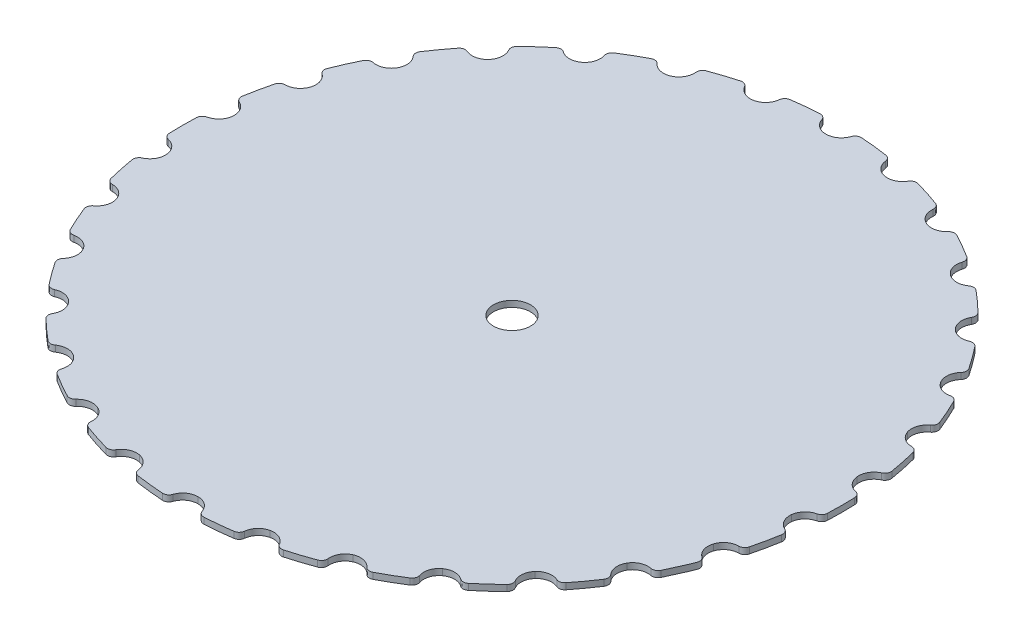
from build123d import *

# Parameters (mm, degrees)
SKETCH1_R           = 3
BOSS_EXTRUDE1_DEPTH = 1


with BuildPart() as part:
    # Sketch1 → Boss-Extrude1 (new body)
    with BuildSketch(Plane(origin=(0, 0, 0), x_dir=(1, 0, 0), z_dir=(0, 1, 0))):
        with BuildLine():
            add(Edge.make_bspline(
                [(-30.729, 38.4268), (-29.6819, 39.4503), (-28.5937, 40.4313), (-27.4664, 41.3656), (-27.1101, 41.6609), (-26.6154, 41.6768), (-26.2409, 41.405)],
                knots=[0.986666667, 0.986666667, 0.986666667, 0.986666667, 0.993333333, 0.993333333, 0.993333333, 1, 1, 1, 1], degree=3))
            add(Edge.make_bspline(
                [(-26.2409, 41.405), (-25.3885, 40.7865), (-24.2014, 40.754), (-23.3032, 41.4066)],
                knots=[0, 0, 0, 0, 0.006666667, 0.006666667, 0.006666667, 0.006666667], degree=3))
            add(Edge.make_bspline(
                [(-23.3032, 41.4066), (-22.4043, 42.0597), (-22.0687, 43.2), (-22.3949, 44.2023)],
                knots=[0.006666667, 0.006666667, 0.006666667, 0.006666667, 0.013333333, 0.013333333, 0.013333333, 0.013333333], degree=3))
            add(Edge.make_bspline(
                [(-22.3949, 44.2023), (-22.5381, 44.6424), (-22.3705, 45.1081), (-21.9797, 45.3562)],
                knots=[0.013333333, 0.013333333, 0.013333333, 0.013333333, 0.02, 0.02, 0.02, 0.02], degree=3))
            add(Edge.make_bspline(
                [(-21.9797, 45.3562), (-20.7353, 46.1457), (-19.4671, 46.878), (-18.1791, 47.5531)],
                knots=[0.02, 0.02, 0.02, 0.02, 0.026666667, 0.026666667, 0.026666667, 0.026666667], degree=3))
            add(Edge.make_bspline(
                [(-18.1791, 47.5531), (-17.7687, 47.7682), (-17.2808, 47.6804), (-16.9711, 47.3357)],
                knots=[0.026666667, 0.026666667, 0.026666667, 0.026666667, 0.033333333, 0.033333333, 0.033333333, 0.033333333], degree=3))
            add(Edge.make_bspline(
                [(-16.9711, 47.3357), (-16.2662, 46.5511), (-15.1102, 46.2714), (-14.0947, 46.7236)],
                knots=[0.033333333, 0.033333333, 0.033333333, 0.033333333, 0.04, 0.04, 0.04, 0.04], degree=3))
            add(Edge.make_bspline(
                [(-14.0947, 46.7236), (-13.0798, 47.1755), (-12.5144, 48.2207), (-12.6248, 49.269)],
                knots=[0.04, 0.04, 0.04, 0.04, 0.046666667, 0.046666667, 0.046666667, 0.046666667], degree=3))
            add(Edge.make_bspline(
                [(-12.6248, 49.269), (-12.6734, 49.7298), (-12.4119, 50.1508), (-11.9774, 50.3116)],
                knots=[0.046666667, 0.046666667, 0.046666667, 0.046666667, 0.053333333, 0.053333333, 0.053333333, 0.053333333], degree=3))
            add(Edge.make_bspline(
                [(-11.9774, 50.3116), (-10.5987, 50.8219), (-9.2044, 51.2724), (-7.7986, 51.6636)],
                knots=[0.053333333, 0.053333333, 0.053333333, 0.053333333, 0.06, 0.06, 0.06, 0.06], degree=3))
            add(Edge.make_bspline(
                [(-7.7986, 51.6636), (-7.3536, 51.7874), (-6.8967, 51.6012), (-6.6652, 51.2015)],
                knots=[0.06, 0.06, 0.06, 0.06, 0.066666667, 0.066666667, 0.066666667, 0.066666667], degree=3))
            add(Edge.make_bspline(
                [(-6.6652, 51.2015), (-6.1378, 50.2906), (-5.0672, 49.779), (-3.9819, 50.0097)],
                knots=[0.066666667, 0.066666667, 0.066666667, 0.066666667, 0.073333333, 0.073333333, 0.073333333, 0.073333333], degree=3))
            add(Edge.make_bspline(
                [(-3.9819, 50.0097), (-2.8995, 50.2399), (-2.1307, 51.1386), (-2.0162, 52.1817)],
                knots=[0.073333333, 0.073333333, 0.073333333, 0.073333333, 0.08, 0.08, 0.08, 0.08], degree=3))
            add(Edge.make_bspline(
                [(-2.0162, 52.1817), (-1.9658, 52.6408), (-1.6229, 52.9958), (-1.1658, 53.0621)],
                knots=[0.08, 0.08, 0.08, 0.08, 0.086666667, 0.086666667, 0.086666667, 0.086666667], degree=3))
            add(Edge.make_bspline(
                [(-1.1658, 53.0621), (0.288, 53.2731), (1.7478, 53.4241), (3.2093, 53.5148)],
                knots=[0.086666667, 0.086666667, 0.086666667, 0.086666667, 0.093333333, 0.093333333, 0.093333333, 0.093333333], degree=3))
            add(Edge.make_bspline(
                [(3.2093, 53.5148), (3.6684, 53.5433), (4.0752, 53.2686), (4.2203, 52.8321)],
                knots=[0.093333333, 0.093333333, 0.093333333, 0.093333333, 0.1, 0.1, 0.1, 0.1], degree=3))
            add(Edge.make_bspline(
                [(4.2203, 52.8321), (4.5506, 51.8383), (5.4883, 51.1215), (6.5932, 51.1215), (7.6964, 51.1215), (8.6327, 51.8363), (8.9645, 52.8278)],
                knots=[0.1, 0.1, 0.1, 0.1, 0.106666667, 0.106666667, 0.106666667, 0.113333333, 0.113333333, 0.113333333, 0.113333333], degree=3))
            add(Edge.make_bspline(
                [(8.9645, 52.8278), (9.1105, 53.2639), (9.5175, 53.5377), (9.9765, 53.5084)],
                knots=[0.113333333, 0.113333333, 0.113333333, 0.113333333, 0.12, 0.12, 0.12, 0.12], degree=3))
            add(Edge.make_bspline(
                [(9.9765, 53.5084), (11.4417, 53.4148), (12.9025, 53.2611), (14.3551, 53.0482), (14.8102, 52.9815), (15.1514, 52.629), (15.2035, 52.172)],
                knots=[0.12, 0.12, 0.12, 0.12, 0.126666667, 0.126666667, 0.126666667, 0.133333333, 0.133333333, 0.133333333, 0.133333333], degree=3))
            add(Edge.make_bspline(
                [(15.2035, 52.172), (15.3219, 51.1331), (16.089, 50.2395), (17.1683, 50.0103)],
                knots=[0.133333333, 0.133333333, 0.133333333, 0.133333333, 0.14, 0.14, 0.14, 0.14], degree=3))
            add(Edge.make_bspline(
                [(17.1683, 50.0103), (18.249, 49.7806), (19.3149, 50.2868), (19.8449, 51.1902)],
                knots=[0.14, 0.14, 0.14, 0.14, 0.146666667, 0.146666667, 0.146666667, 0.146666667], degree=3))
            add(Edge.make_bspline(
                [(19.8449, 51.1902), (20.0776, 51.5869), (20.5325, 51.7709), (20.9756, 51.6476)],
                knots=[0.146666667, 0.146666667, 0.146666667, 0.146666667, 0.153333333, 0.153333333, 0.153333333, 0.153333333], degree=3))
            add(Edge.make_bspline(
                [(20.9756, 51.6476), (22.3864, 51.2549), (23.783, 50.8041), (25.1612, 50.2953)],
                knots=[0.153333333, 0.153333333, 0.153333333, 0.153333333, 0.16, 0.16, 0.16, 0.16], degree=3))
            add(Edge.make_bspline(
                [(25.1612, 50.2953), (25.5945, 50.1353), (25.8559, 49.7169), (25.8099, 49.2573)],
                knots=[0.16, 0.16, 0.16, 0.16, 0.166666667, 0.166666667, 0.166666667, 0.166666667], degree=3))
            add(Edge.make_bspline(
                [(25.8099, 49.2573), (25.7052, 48.2133), (26.2703, 47.1746), (27.2813, 46.7247)],
                knots=[0.166666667, 0.166666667, 0.166666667, 0.166666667, 0.173333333, 0.173333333, 0.173333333, 0.173333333], degree=3))
            add(Edge.make_bspline(
                [(27.2813, 46.7247), (28.2948, 46.2737), (29.448, 46.5513), (30.1534, 47.3321)],
                knots=[0.173333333, 0.173333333, 0.173333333, 0.173333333, 0.18, 0.18, 0.18, 0.18], degree=3))
            add(Edge.make_bspline(
                [(30.1534, 47.3321), (30.463, 47.6748), (30.9487, 47.7621), (31.3581, 47.5484)],
                knots=[0.18, 0.18, 0.18, 0.18, 0.186666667, 0.186666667, 0.186666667, 0.186666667], degree=3))
            add(Edge.make_bspline(
                [(31.3581, 47.5484), (32.6518, 46.8734), (33.9219, 46.1427), (35.1647, 45.3571)],
                knots=[0.186666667, 0.186666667, 0.186666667, 0.186666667, 0.193333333, 0.193333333, 0.193333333, 0.193333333], degree=3))
            add(Edge.make_bspline(
                [(35.1647, 45.3571), (35.5562, 45.1095), (35.7244, 44.6434), (35.5813, 44.2029)],
                knots=[0.193333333, 0.193333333, 0.193333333, 0.193333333, 0.2, 0.2, 0.2, 0.2], degree=3))
            add(Edge.make_bspline(
                [(35.5813, 44.2029), (35.2556, 43.2007), (35.5914, 42.0611), (36.4902, 41.4082)],
                knots=[0.2, 0.2, 0.2, 0.2, 0.206666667, 0.206666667, 0.206666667, 0.206666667], degree=3))
            add(Edge.make_bspline(
                [(36.4902, 41.4082), (37.3891, 40.7551), (38.5777, 40.7882), (39.4302, 41.4083)],
                knots=[0.206666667, 0.206666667, 0.206666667, 0.206666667, 0.213333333, 0.213333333, 0.213333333, 0.213333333], degree=3))
            add(Edge.make_bspline(
                [(39.4302, 41.4083), (39.8048, 41.6808), (40.3, 41.6652), (40.6566, 41.3696)],
                knots=[0.213333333, 0.213333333, 0.213333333, 0.213333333, 0.22, 0.22, 0.22, 0.22], degree=3))
            add(Edge.make_bspline(
                [(40.6566, 41.3696), (41.7763, 40.4415), (42.8648, 39.4618), (43.918, 38.4307)],
                knots=[0.22, 0.22, 0.22, 0.22, 0.226666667, 0.226666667, 0.226666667, 0.226666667], degree=3))
            add(Edge.make_bspline(
                [(43.918, 38.4307), (44.2487, 38.107), (44.3159, 37.6168), (44.0845, 37.2161)],
                knots=[0.226666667, 0.226666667, 0.226666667, 0.226666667, 0.233333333, 0.233333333, 0.233333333, 0.233333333], degree=3))
            add(Edge.make_bspline(
                [(44.0845, 37.2161), (43.5575, 36.3035), (43.649, 35.1188), (44.3925, 34.2933)],
                knots=[0.233333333, 0.233333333, 0.233333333, 0.233333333, 0.24, 0.24, 0.24, 0.24], degree=3))
            add(Edge.make_bspline(
                [(44.3925, 34.2933), (45.1352, 33.4685), (46.3028, 33.2532), (47.2651, 33.6807)],
                knots=[0.24, 0.24, 0.24, 0.24, 0.246666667, 0.246666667, 0.246666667, 0.246666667], degree=3))
            add(Edge.make_bspline(
                [(47.2651, 33.6807), (47.6877, 33.8684), (48.1677, 33.7503), (48.4548, 33.3879)],
                knots=[0.246666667, 0.246666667, 0.246666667, 0.246666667, 0.253333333, 0.253333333, 0.253333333, 0.253333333], degree=3))
            add(Edge.make_bspline(
                [(48.4548, 33.3879), (49.3642, 32.2402), (50.2259, 31.0561), (51.0382, 29.8376)],
                knots=[0.253333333, 0.253333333, 0.253333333, 0.253333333, 0.26, 0.26, 0.26, 0.26], degree=3))
            add(Edge.make_bspline(
                [(51.0382, 29.8376), (51.2951, 29.4522), (51.2592, 28.958), (50.9492, 28.6138)],
                knots=[0.26, 0.26, 0.26, 0.26, 0.266666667, 0.266666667, 0.266666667, 0.266666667], degree=3))
            add(Edge.make_bspline(
                [(50.9492, 28.6138), (50.244, 27.8307), (50.0873, 26.653), (50.6428, 25.691)],
                knots=[0.266666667, 0.266666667, 0.266666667, 0.266666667, 0.273333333, 0.273333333, 0.273333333, 0.273333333], degree=3))
            add(Edge.make_bspline(
                [(50.6428, 25.691), (51.1986, 24.7284), (52.2982, 24.2752), (53.3295, 24.4954)],
                knots=[0.273333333, 0.273333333, 0.273333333, 0.273333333, 0.28, 0.28, 0.28, 0.28], degree=3))
            add(Edge.make_bspline(
                [(53.3295, 24.4954), (53.7825, 24.5922), (54.2286, 24.3766), (54.4343, 23.9616)],
                knots=[0.28, 0.28, 0.28, 0.28, 0.286666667, 0.286666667, 0.286666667, 0.286666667], degree=3))
            add(Edge.make_bspline(
                [(54.4343, 23.9616), (55.0878, 22.643), (55.6826, 21.3046), (56.2187, 19.9503)],
                knots=[0.286666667, 0.286666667, 0.286666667, 0.286666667, 0.293333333, 0.293333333, 0.293333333, 0.293333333], degree=3))
            add(Edge.make_bspline(
                [(56.2187, 19.9503), (56.3891, 19.5199), (56.2509, 19.0448), (55.8763, 18.7729)],
                knots=[0.293333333, 0.293333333, 0.293333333, 0.293333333, 0.3, 0.3, 0.3, 0.3], degree=3))
            add(Edge.make_bspline(
                [(55.8763, 18.7729), (55.0231, 18.1537), (54.6246, 17.0338), (54.968, 15.9771)],
                knots=[0.3, 0.3, 0.3, 0.3, 0.306666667, 0.306666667, 0.306666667, 0.306666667], degree=3))
            add(Edge.make_bspline(
                [(54.968, 15.9771), (55.3107, 14.9225), (56.2882, 14.2511), (57.3401, 14.249)],
                knots=[0.306666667, 0.306666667, 0.306666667, 0.306666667, 0.313333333, 0.313333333, 0.313333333, 0.313333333], degree=3))
            add(Edge.make_bspline(
                [(57.3401, 14.249), (57.8028, 14.248), (58.1931, 13.9439), (58.3071, 13.4955)],
                knots=[0.313333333, 0.313333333, 0.313333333, 0.313333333, 0.32, 0.32, 0.32, 0.32], degree=3))
            add(Edge.make_bspline(
                [(58.3071, 13.4955), (58.6692, 12.0714), (58.9713, 10.6364), (59.2134, 9.1947)],
                knots=[0.32, 0.32, 0.32, 0.32, 0.326666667, 0.326666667, 0.326666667, 0.326666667], degree=3))
            add(Edge.make_bspline(
                [(59.2134, 9.1947), (59.2897, 8.7403), (59.058, 8.3065), (58.6379, 8.1173)],
                knots=[0.326666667, 0.326666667, 0.326666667, 0.326666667, 0.333333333, 0.333333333, 0.333333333, 0.333333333], degree=3))
            add(Edge.make_bspline(
                [(58.6379, 8.1173), (57.6809, 7.6862), (57.0634, 6.677), (57.1791, 5.5761)],
                knots=[0.333333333, 0.333333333, 0.333333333, 0.333333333, 0.34, 0.34, 0.34, 0.34], degree=3))
            add(Edge.make_bspline(
                [(57.1791, 5.5761), (57.2945, 4.478), (58.1046, 3.6209), (59.1267, 3.3955)],
                knots=[0.34, 0.34, 0.34, 0.34, 0.346666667, 0.346666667, 0.346666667, 0.346666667], degree=3))
            add(Edge.make_bspline(
                [(59.1267, 3.3955), (59.5765, 3.2963), (59.8921, 2.9192), (59.9105, 2.4589)],
                knots=[0.346666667, 0.346666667, 0.346666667, 0.346666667, 0.353333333, 0.353333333, 0.353333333, 0.353333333], degree=3))
            add(Edge.make_bspline(
                [(59.9105, 2.4589), (59.9691, 0.9911), (59.9679, -0.4776), (59.9065, -1.9429)],
                knots=[0.353333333, 0.353333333, 0.353333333, 0.353333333, 0.36, 0.36, 0.36, 0.36], degree=3))
            add(Edge.make_bspline(
                [(59.9065, -1.9429), (59.8872, -2.4021), (59.5725, -2.7777), (59.1238, -2.8772)],
                knots=[0.36, 0.36, 0.36, 0.36, 0.366666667, 0.366666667, 0.366666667, 0.366666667], degree=3))
            add(Edge.make_bspline(
                [(59.1238, -2.8772), (58.1031, -3.1035), (57.2948, -3.9601), (57.1794, -5.0572)],
                knots=[0.366666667, 0.366666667, 0.366666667, 0.366666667, 0.373333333, 0.373333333, 0.373333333, 0.373333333], degree=3))
            add(Edge.make_bspline(
                [(57.1794, -5.0572), (57.0642, -6.1544), (57.677, -7.1605), (58.6287, -7.5941)],
                knots=[0.373333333, 0.373333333, 0.373333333, 0.373333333, 0.38, 0.38, 0.38, 0.38], degree=3))
            add(Edge.make_bspline(
                [(58.6287, -7.5941), (59.0469, -7.7847), (59.2767, -8.2177), (59.2, -8.6709)],
                knots=[0.38, 0.38, 0.38, 0.38, 0.386666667, 0.386666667, 0.386666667, 0.386666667], degree=3))
            add(Edge.make_bspline(
                [(59.2, -8.6709), (58.9553, -10.117), (58.6514, -11.5537), (58.2888, -12.9771)],
                knots=[0.386666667, 0.386666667, 0.386666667, 0.386666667, 0.393333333, 0.393333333, 0.393333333, 0.393333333], degree=3))
            add(Edge.make_bspline(
                [(58.2888, -12.9771), (58.1751, -13.4235), (57.7879, -13.7267), (57.3272, -13.7302)],
                knots=[0.393333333, 0.393333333, 0.393333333, 0.393333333, 0.4, 0.4, 0.4, 0.4], degree=3))
            add(Edge.make_bspline(
                [(57.3272, -13.7302), (56.2805, -13.738), (55.3102, -14.408), (54.9689, -15.4582)],
                knots=[0.4, 0.4, 0.4, 0.4, 0.406666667, 0.406666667, 0.406666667, 0.406666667], degree=3))
            add(Edge.make_bspline(
                [(54.9689, -15.4582), (54.627, -16.5108), (55.0208, -17.6261), (55.867, -18.2469), (56.2383, -18.5193), (56.3748, -18.9917), (56.2058, -19.4201), (55.6693, -20.7801), (55.0765, -22.1213), (54.4264, -23.4391)],
                knots=[0.406666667, 0.406666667, 0.406666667, 0.406666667, 0.413333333, 0.413333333, 0.413333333, 0.42, 0.42, 0.42, 0.426666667, 0.426666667, 0.426666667, 0.426666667], degree=3))
            add(Edge.make_bspline(
                [(54.4264, -23.4391), (54.2216, -23.8542), (53.7765, -24.0705), (53.3236, -23.9753)],
                knots=[0.426666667, 0.426666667, 0.426666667, 0.426666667, 0.433333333, 0.433333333, 0.433333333, 0.433333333], degree=3))
            add(Edge.make_bspline(
                [(53.3236, -23.9753), (52.2943, -23.7586), (51.1987, -24.2119), (50.6441, -25.1723)],
                knots=[0.433333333, 0.433333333, 0.433333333, 0.433333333, 0.44, 0.44, 0.44, 0.44], degree=3))
            add(Edge.make_bspline(
                [(50.6441, -25.1723), (50.0888, -26.1344), (50.2455, -27.3123), (50.9507, -28.0954)],
                knots=[0.44, 0.44, 0.44, 0.44, 0.446666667, 0.446666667, 0.446666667, 0.446666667], degree=3))
            add(Edge.make_bspline(
                [(50.9507, -28.0954), (51.2603, -28.4391), (51.2966, -28.9324), (51.0407, -29.3178)],
                knots=[0.446666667, 0.446666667, 0.446666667, 0.446666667, 0.453333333, 0.453333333, 0.453333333, 0.453333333], degree=3))
            add(Edge.make_bspline(
                [(51.0407, -29.3178), (50.2349, -30.5312), (49.3761, -31.7175), (48.4631, -32.8716)],
                knots=[0.453333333, 0.453333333, 0.453333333, 0.453333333, 0.46, 0.46, 0.46, 0.46], degree=3))
            add(Edge.make_bspline(
                [(48.4631, -32.8716), (48.1756, -33.235), (47.6942, -33.3532), (47.2711, -33.1643)],
                knots=[0.46, 0.46, 0.46, 0.46, 0.466666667, 0.466666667, 0.466666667, 0.466666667], degree=3))
            add(Edge.make_bspline(
                [(47.2711, -33.1643), (46.3079, -32.7342), (45.1382, -32.9489), (44.3943, -33.775)],
                knots=[0.466666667, 0.466666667, 0.466666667, 0.466666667, 0.473333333, 0.473333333, 0.473333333, 0.473333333], degree=3))
            add(Edge.make_bspline(
                [(44.3943, -33.775), (43.6516, -34.6001), (43.5596, -35.7838), (44.0854, -36.6962)],
                knots=[0.473333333, 0.473333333, 0.473333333, 0.473333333, 0.48, 0.48, 0.48, 0.48], degree=3))
            add(Edge.make_bspline(
                [(44.0854, -36.6962), (44.3164, -37.0971), (44.2489, -37.5872), (43.918, -37.9106)],
                knots=[0.48, 0.48, 0.48, 0.48, 0.486666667, 0.486666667, 0.486666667, 0.486666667], degree=3))
            add(Edge.make_bspline(
                [(43.918, -37.9106), (42.8709, -38.9339), (41.7827, -39.9152), (40.6555, -40.8494)],
                knots=[0.486666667, 0.486666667, 0.486666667, 0.486666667, 0.493333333, 0.493333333, 0.493333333, 0.493333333], degree=3))
            add(Edge.make_bspline(
                [(40.6555, -40.8494), (40.2992, -41.1447), (39.8045, -41.1606), (39.43, -40.8887)],
                knots=[0.493333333, 0.493333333, 0.493333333, 0.493333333, 0.5, 0.5, 0.5, 0.5], degree=3))
            add(Edge.make_bspline(
                [(39.43, -40.8887), (38.5777, -40.27), (37.3907, -40.2377), (36.4923, -40.8903)],
                knots=[0.5, 0.5, 0.5, 0.5, 0.506666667, 0.506666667, 0.506666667, 0.506666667], degree=3))
            add(Edge.make_bspline(
                [(36.4923, -40.8903), (35.5935, -41.5436), (35.2578, -42.6837), (35.5839, -43.6863)],
                knots=[0.506666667, 0.506666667, 0.506666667, 0.506666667, 0.513333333, 0.513333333, 0.513333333, 0.513333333], degree=3))
            add(Edge.make_bspline(
                [(35.5839, -43.6863), (35.7271, -44.1264), (35.5596, -44.5921), (35.1688, -44.8401)],
                knots=[0.513333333, 0.513333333, 0.513333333, 0.513333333, 0.52, 0.52, 0.52, 0.52], degree=3))
            add(Edge.make_bspline(
                [(35.1688, -44.8401), (33.9245, -45.6298), (32.6563, -46.362), (31.3684, -47.0369)],
                knots=[0.52, 0.52, 0.52, 0.52, 0.526666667, 0.526666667, 0.526666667, 0.526666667], degree=3))
            add(Edge.make_bspline(
                [(31.3684, -47.0369), (30.9579, -47.252), (30.47, -47.1643), (30.1603, -46.8195)],
                knots=[0.526666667, 0.526666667, 0.526666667, 0.526666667, 0.533333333, 0.533333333, 0.533333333, 0.533333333], degree=3))
            add(Edge.make_bspline(
                [(30.1603, -46.8195), (29.4554, -46.0349), (28.2994, -45.7551), (27.2838, -46.2072)],
                knots=[0.533333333, 0.533333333, 0.533333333, 0.533333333, 0.54, 0.54, 0.54, 0.54], degree=3))
            add(Edge.make_bspline(
                [(27.2838, -46.2072), (26.2688, -46.6592), (25.7033, -47.7047), (25.8138, -48.7531)],
                knots=[0.54, 0.54, 0.54, 0.54, 0.546666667, 0.546666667, 0.546666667, 0.546666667], degree=3))
            add(Edge.make_bspline(
                [(25.8138, -48.7531), (25.8625, -49.2139), (25.601, -49.6351), (25.1664, -49.7959)],
                knots=[0.546666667, 0.546666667, 0.546666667, 0.546666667, 0.553333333, 0.553333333, 0.553333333, 0.553333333], degree=3))
            add(Edge.make_bspline(
                [(25.1664, -49.7959), (23.7878, -50.3059), (22.3936, -50.7566), (20.9881, -51.1478)],
                knots=[0.553333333, 0.553333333, 0.553333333, 0.553333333, 0.56, 0.56, 0.56, 0.56], degree=3))
            add(Edge.make_bspline(
                [(20.9881, -51.1478), (20.543, -51.2716), (20.0859, -51.0852), (19.8545, -50.6853)],
                knots=[0.56, 0.56, 0.56, 0.56, 0.566666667, 0.566666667, 0.566666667, 0.566666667], degree=3))
            add(Edge.make_bspline(
                [(19.8545, -50.6853), (19.3272, -49.7744), (18.2565, -49.2627), (17.171, -49.4934)],
                knots=[0.566666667, 0.566666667, 0.566666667, 0.566666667, 0.573333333, 0.573333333, 0.573333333, 0.573333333], degree=3))
            add(Edge.make_bspline(
                [(17.171, -49.4934), (16.0883, -49.7235), (15.3195, -50.6225), (15.2051, -51.6659)],
                knots=[0.573333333, 0.573333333, 0.573333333, 0.573333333, 0.58, 0.58, 0.58, 0.58], degree=3))
            add(Edge.make_bspline(
                [(15.2051, -51.6659), (15.1547, -52.125), (14.8118, -52.4801), (14.3547, -52.5464)],
                knots=[0.58, 0.58, 0.58, 0.58, 0.586666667, 0.586666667, 0.586666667, 0.586666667], degree=3))
            add(Edge.make_bspline(
                [(14.3547, -52.5464), (12.901, -52.7573), (11.4412, -52.9081), (9.9798, -52.9988)],
                knots=[0.586666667, 0.586666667, 0.586666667, 0.586666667, 0.593333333, 0.593333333, 0.593333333, 0.593333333], degree=3))
            add(Edge.make_bspline(
                [(9.9798, -52.9988), (9.5207, -53.0273), (9.1141, -52.7526), (8.9689, -52.316)],
                knots=[0.593333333, 0.593333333, 0.593333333, 0.593333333, 0.6, 0.6, 0.6, 0.6], degree=3))
            add(Edge.make_bspline(
                [(8.9689, -52.316), (8.6386, -51.322), (7.7009, -50.6053), (6.5959, -50.6052)],
                knots=[0.6, 0.6, 0.6, 0.6, 0.606666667, 0.606666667, 0.606666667, 0.606666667], degree=3))
            add(Edge.make_bspline(
                [(6.5959, -50.6052), (5.4926, -50.6053), (4.5562, -51.3199), (4.2244, -52.3117)],
                knots=[0.606666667, 0.606666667, 0.606666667, 0.606666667, 0.613333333, 0.613333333, 0.613333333, 0.613333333], degree=3))
            add(Edge.make_bspline(
                [(4.2244, -52.3117), (4.0785, -52.7479), (3.6713, -53.0218), (3.2123, -52.9924)],
                knots=[0.613333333, 0.613333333, 0.613333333, 0.613333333, 0.62, 0.62, 0.62, 0.62], degree=3))
            add(Edge.make_bspline(
                [(3.2123, -52.9924), (1.7473, -52.8986), (0.2864, -52.745), (-1.166, -52.5319)],
                knots=[0.62, 0.62, 0.62, 0.62, 0.626666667, 0.626666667, 0.626666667, 0.626666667], degree=3))
            add(Edge.make_bspline(
                [(-1.166, -52.5319), (-1.6211, -52.4651), (-1.9623, -52.1127), (-2.0144, -51.6557)],
                knots=[0.626666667, 0.626666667, 0.626666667, 0.626666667, 0.633333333, 0.633333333, 0.633333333, 0.633333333], degree=3))
            add(Edge.make_bspline(
                [(-2.0144, -51.6557), (-2.1328, -50.617), (-2.9001, -49.7233), (-3.9792, -49.494)],
                knots=[0.633333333, 0.633333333, 0.633333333, 0.633333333, 0.64, 0.64, 0.64, 0.64], degree=3))
            add(Edge.make_bspline(
                [(-3.9792, -49.494), (-5.0596, -49.2645), (-6.1253, -49.7704), (-6.6554, -50.6733)],
                knots=[0.64, 0.64, 0.64, 0.64, 0.646666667, 0.646666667, 0.646666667, 0.646666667], degree=3))
            add(Edge.make_bspline(
                [(-6.6554, -50.6733), (-6.8882, -51.0699), (-7.343, -51.2538), (-7.786, -51.1305)],
                knots=[0.646666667, 0.646666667, 0.646666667, 0.646666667, 0.653333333, 0.653333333, 0.653333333, 0.653333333], degree=3))
            add(Edge.make_bspline(
                [(-7.786, -51.1305), (-9.1969, -50.7377), (-10.5936, -50.2867), (-11.972, -49.778)],
                knots=[0.653333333, 0.653333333, 0.653333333, 0.653333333, 0.66, 0.66, 0.66, 0.66], degree=3))
            add(Edge.make_bspline(
                [(-11.972, -49.778), (-12.4051, -49.6181), (-12.6666, -49.1998), (-12.6208, -48.7404)],
                knots=[0.66, 0.66, 0.66, 0.66, 0.666666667, 0.666666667, 0.666666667, 0.666666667], degree=3))
            add(Edge.make_bspline(
                [(-12.6208, -48.7404), (-12.5165, -47.6968), (-13.0815, -46.6585), (-14.0922, -46.2083)],
                knots=[0.666666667, 0.666666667, 0.666666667, 0.666666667, 0.673333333, 0.673333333, 0.673333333, 0.673333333], degree=3))
            add(Edge.make_bspline(
                [(-14.0922, -46.2083), (-15.1056, -45.7573), (-16.2588, -46.0349), (-16.9642, -46.8157)],
                knots=[0.673333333, 0.673333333, 0.673333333, 0.673333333, 0.68, 0.68, 0.68, 0.68], degree=3))
            add(Edge.make_bspline(
                [(-16.9642, -46.8157), (-17.2738, -47.1583), (-17.7593, -47.2455), (-18.1687, -47.0319)],
                knots=[0.68, 0.68, 0.68, 0.68, 0.686666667, 0.686666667, 0.686666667, 0.686666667], degree=3))
            add(Edge.make_bspline(
                [(-18.1687, -47.0319), (-19.4625, -46.357), (-20.7328, -45.6266), (-21.9756, -44.8409)],
                knots=[0.686666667, 0.686666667, 0.686666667, 0.686666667, 0.693333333, 0.693333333, 0.693333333, 0.693333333], degree=3))
            add(Edge.make_bspline(
                [(-21.9756, -44.8409), (-22.3672, -44.5934), (-22.5354, -44.1273), (-22.3922, -43.6867), (-22.0665, -42.6846), (-22.4024, -41.545), (-23.3011, -40.8919)],
                knots=[0.693333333, 0.693333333, 0.693333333, 0.693333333, 0.7, 0.7, 0.7, 0.706666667, 0.706666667, 0.706666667, 0.706666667], degree=3))
            add(Edge.make_bspline(
                [(-23.3011, -40.8919), (-24.1999, -40.2391), (-25.3879, -40.2719), (-26.2405, -40.8918)],
                knots=[0.706666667, 0.706666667, 0.706666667, 0.706666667, 0.713333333, 0.713333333, 0.713333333, 0.713333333], degree=3))
            add(Edge.make_bspline(
                [(-26.2405, -40.8918), (-26.615, -41.1641), (-27.1101, -41.1484), (-27.4666, -40.8529)],
                knots=[0.713333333, 0.713333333, 0.713333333, 0.713333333, 0.72, 0.72, 0.72, 0.72], degree=3))
            add(Edge.make_bspline(
                [(-27.4666, -40.8529), (-28.5865, -39.9246), (-29.6752, -38.9448), (-30.7285, -37.9137)],
                knots=[0.72, 0.72, 0.72, 0.72, 0.726666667, 0.726666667, 0.726666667, 0.726666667], degree=3))
            add(Edge.make_bspline(
                [(-30.7285, -37.9137), (-31.0591, -37.5901), (-31.1263, -37.1), (-30.8951, -36.6993), (-30.3686, -35.7868), (-30.4602, -34.6026), (-31.2033, -33.777)],
                knots=[0.726666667, 0.726666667, 0.726666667, 0.726666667, 0.733333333, 0.733333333, 0.733333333, 0.74, 0.74, 0.74, 0.74], degree=3))
            add(Edge.make_bspline(
                [(-31.2033, -33.777), (-31.9458, -32.9528), (-33.1123, -32.7374), (-34.0743, -33.1639)],
                knots=[0.74, 0.74, 0.74, 0.74, 0.746666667, 0.746666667, 0.746666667, 0.746666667], degree=3))
            add(Edge.make_bspline(
                [(-34.0743, -33.1639), (-34.4969, -33.3512), (-34.9766, -33.2329), (-35.2635, -32.8705)],
                knots=[0.746666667, 0.746666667, 0.746666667, 0.746666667, 0.753333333, 0.753333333, 0.753333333, 0.753333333], degree=3))
            add(Edge.make_bspline(
                [(-35.2635, -32.8705), (-36.1744, -31.7202), (-37.0343, -30.542), (-37.8487, -29.3214)],
                knots=[0.753333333, 0.753333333, 0.753333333, 0.753333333, 0.76, 0.76, 0.76, 0.76], degree=3))
            add(Edge.make_bspline(
                [(-37.8487, -29.3214), (-38.1058, -28.936), (-38.07, -28.4417), (-37.76, -28.0974)],
                knots=[0.76, 0.76, 0.76, 0.76, 0.766666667, 0.766666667, 0.766666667, 0.766666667], degree=3))
            add(Edge.make_bspline(
                [(-37.76, -28.0974), (-37.055, -27.3142), (-36.8985, -26.1366), (-37.4537, -25.1746)],
                knots=[0.766666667, 0.766666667, 0.766666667, 0.766666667, 0.773333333, 0.773333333, 0.773333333, 0.773333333], degree=3))
            add(Edge.make_bspline(
                [(-37.4537, -25.1746), (-38.0095, -24.2122), (-39.109, -23.7591), (-40.1404, -23.9792)],
                knots=[0.773333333, 0.773333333, 0.773333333, 0.773333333, 0.78, 0.78, 0.78, 0.78], degree=3))
            add(Edge.make_bspline(
                [(-40.1404, -23.9792), (-40.5934, -24.0759), (-41.0396, -23.8603), (-41.2452, -23.4453)],
                knots=[0.78, 0.78, 0.78, 0.78, 0.786666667, 0.786666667, 0.786666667, 0.786666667], degree=3))
            add(Edge.make_bspline(
                [(-41.2452, -23.4453), (-41.8987, -22.1268), (-42.4933, -20.7882), (-43.0295, -19.434)],
                knots=[0.786666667, 0.786666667, 0.786666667, 0.786666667, 0.793333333, 0.793333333, 0.793333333, 0.793333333], degree=3))
            add(Edge.make_bspline(
                [(-43.0295, -19.434), (-43.1998, -19.0037), (-43.0618, -18.5286), (-42.6873, -18.2567)],
                knots=[0.793333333, 0.793333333, 0.793333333, 0.793333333, 0.8, 0.8, 0.8, 0.8], degree=3))
            add(Edge.make_bspline(
                [(-42.6873, -18.2567), (-41.8342, -17.6374), (-41.4356, -16.5176), (-41.7789, -15.4608)],
                knots=[0.8, 0.8, 0.8, 0.8, 0.806666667, 0.806666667, 0.806666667, 0.806666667], degree=3))
            add(Edge.make_bspline(
                [(-41.7789, -15.4608), (-42.1217, -14.4062), (-43.0991, -13.735), (-44.151, -13.7328)],
                knots=[0.806666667, 0.806666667, 0.806666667, 0.806666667, 0.813333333, 0.813333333, 0.813333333, 0.813333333], degree=3))
            add(Edge.make_bspline(
                [(-44.151, -13.7328), (-44.6137, -13.7318), (-45.0041, -13.4277), (-45.1181, -12.9794)],
                knots=[0.813333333, 0.813333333, 0.813333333, 0.813333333, 0.82, 0.82, 0.82, 0.82], degree=3))
            add(Edge.make_bspline(
                [(-45.1181, -12.9794), (-45.4801, -11.5553), (-45.7824, -10.1202), (-46.0244, -8.6785)],
                knots=[0.82, 0.82, 0.82, 0.82, 0.826666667, 0.826666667, 0.826666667, 0.826666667], degree=3))
            add(Edge.make_bspline(
                [(-46.0244, -8.6785), (-46.1007, -8.2242), (-45.869, -7.7903), (-45.4489, -7.6011)],
                knots=[0.826666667, 0.826666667, 0.826666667, 0.826666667, 0.833333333, 0.833333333, 0.833333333, 0.833333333], degree=3))
            add(Edge.make_bspline(
                [(-45.4489, -7.6011), (-44.4919, -7.1699), (-43.8744, -6.1608), (-43.99, -5.0598)],
                knots=[0.833333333, 0.833333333, 0.833333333, 0.833333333, 0.84, 0.84, 0.84, 0.84], degree=3))
            add(Edge.make_bspline(
                [(-43.99, -5.0598), (-44.1055, -3.9618), (-44.9156, -3.1047), (-45.9377, -2.8794)],
                knots=[0.84, 0.84, 0.84, 0.84, 0.846666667, 0.846666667, 0.846666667, 0.846666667], degree=3))
            add(Edge.make_bspline(
                [(-45.9377, -2.8794), (-46.3875, -2.7802), (-46.7031, -2.4031), (-46.7215, -1.9428)],
                knots=[0.846666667, 0.846666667, 0.846666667, 0.846666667, 0.853333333, 0.853333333, 0.853333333, 0.853333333], degree=3))
            add(Edge.make_bspline(
                [(-46.7215, -1.9428), (-46.7801, -0.475), (-46.7789, 0.9937), (-46.7175, 2.4591)],
                knots=[0.853333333, 0.853333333, 0.853333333, 0.853333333, 0.86, 0.86, 0.86, 0.86], degree=3))
            add(Edge.make_bspline(
                [(-46.7175, 2.4591), (-46.6982, 2.9183), (-46.3835, 3.294), (-45.9348, 3.3935)],
                knots=[0.86, 0.86, 0.86, 0.86, 0.866666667, 0.866666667, 0.866666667, 0.866666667], degree=3))
            add(Edge.make_bspline(
                [(-45.9348, 3.3935), (-44.9142, 3.6199), (-44.1056, 4.4764), (-43.9903, 5.5735)],
                knots=[0.866666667, 0.866666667, 0.866666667, 0.866666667, 0.873333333, 0.873333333, 0.873333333, 0.873333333], degree=3))
            add(Edge.make_bspline(
                [(-43.9903, 5.5735), (-43.8751, 6.6705), (-44.4879, 7.6767), (-45.4396, 8.1102)],
                knots=[0.873333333, 0.873333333, 0.873333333, 0.873333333, 0.88, 0.88, 0.88, 0.88], degree=3))
            add(Edge.make_bspline(
                [(-45.4396, 8.1102), (-45.8578, 8.3008), (-46.0877, 8.7338), (-46.011, 9.187)],
                knots=[0.88, 0.88, 0.88, 0.88, 0.886666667, 0.886666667, 0.886666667, 0.886666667], degree=3))
            add(Edge.make_bspline(
                [(-46.011, 9.187), (-45.7664, 10.6331), (-45.4624, 12.0698), (-45.0998, 13.4933)],
                knots=[0.886666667, 0.886666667, 0.886666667, 0.886666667, 0.893333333, 0.893333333, 0.893333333, 0.893333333], degree=3))
            add(Edge.make_bspline(
                [(-45.0998, 13.4933), (-44.986, 13.9398), (-44.5989, 14.2429), (-44.1383, 14.2464)],
                knots=[0.893333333, 0.893333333, 0.893333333, 0.893333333, 0.9, 0.9, 0.9, 0.9], degree=3))
            add(Edge.make_bspline(
                [(-44.1383, 14.2464), (-43.0915, 14.2541), (-42.1209, 14.9243), (-41.7798, 15.9745)],
                knots=[0.9, 0.9, 0.9, 0.9, 0.906666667, 0.906666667, 0.906666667, 0.906666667], degree=3))
            add(Edge.make_bspline(
                [(-41.7798, 15.9745), (-41.4379, 17.0269), (-41.832, 18.1421), (-42.6781, 18.7629), (-43.0495, 19.0354), (-43.1859, 19.5077), (-43.0169, 19.9362)],
                knots=[0.906666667, 0.906666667, 0.906666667, 0.906666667, 0.913333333, 0.913333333, 0.913333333, 0.92, 0.92, 0.92, 0.92], degree=3))
            add(Edge.make_bspline(
                [(-43.0169, 19.9362), (-42.4804, 21.2962), (-41.8875, 22.6375), (-41.2374, 23.9554)],
                knots=[0.92, 0.92, 0.92, 0.92, 0.926666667, 0.926666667, 0.926666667, 0.926666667], degree=3))
            add(Edge.make_bspline(
                [(-41.2374, 23.9554), (-41.0326, 24.3705), (-40.5875, 24.5868), (-40.1346, 24.4915)],
                knots=[0.926666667, 0.926666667, 0.926666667, 0.926666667, 0.933333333, 0.933333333, 0.933333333, 0.933333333], degree=3))
            add(Edge.make_bspline(
                [(-40.1346, 24.4915), (-39.1054, 24.2749), (-38.0095, 24.7282), (-37.455, 25.6887)],
                knots=[0.933333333, 0.933333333, 0.933333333, 0.933333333, 0.94, 0.94, 0.94, 0.94], degree=3))
            add(Edge.make_bspline(
                [(-37.455, 25.6887), (-36.8997, 26.6506), (-37.0564, 27.8284), (-37.7617, 28.6114)],
                knots=[0.94, 0.94, 0.94, 0.94, 0.946666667, 0.946666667, 0.946666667, 0.946666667], degree=3))
            add(Edge.make_bspline(
                [(-37.7617, 28.6114), (-38.0713, 28.9552), (-38.1076, 29.4484), (-37.8517, 29.8338)],
                knots=[0.946666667, 0.946666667, 0.946666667, 0.946666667, 0.953333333, 0.953333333, 0.953333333, 0.953333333], degree=3))
            add(Edge.make_bspline(
                [(-37.8517, 29.8338), (-37.0459, 31.0474), (-36.187, 32.2337), (-35.274, 33.3879)],
                knots=[0.953333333, 0.953333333, 0.953333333, 0.953333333, 0.96, 0.96, 0.96, 0.96], degree=3))
            add(Edge.make_bspline(
                [(-35.274, 33.3879), (-34.9865, 33.7513), (-34.5051, 33.8694), (-34.082, 33.6805), (-33.1189, 33.2505), (-31.949, 33.4652), (-31.2051, 34.2913)],
                knots=[0.96, 0.96, 0.96, 0.96, 0.966666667, 0.966666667, 0.966666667, 0.973333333, 0.973333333, 0.973333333, 0.973333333], degree=3))
            add(Edge.make_bspline(
                [(-31.2051, 34.2913), (-30.4625, 35.1163), (-30.3707, 36.2999), (-30.8964, 37.2123)],
                knots=[0.973333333, 0.973333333, 0.973333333, 0.973333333, 0.98, 0.98, 0.98, 0.98], degree=3))
            add(Edge.make_bspline(
                [(-30.8964, 37.2123), (-31.1274, 37.6132), (-31.0598, 38.1034), (-30.729, 38.4268)],
                knots=[0.98, 0.98, 0.98, 0.98, 0.986666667, 0.986666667, 0.986666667, 0.986666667], degree=3))
        make_face()
        with Locations(Location((6.5945, 0.258, 0), (0, 0, 270))):
            Circle(SKETCH1_R, mode=Mode.SUBTRACT)
    extrude(amount=BOSS_EXTRUDE1_DEPTH)


solid = part.part
